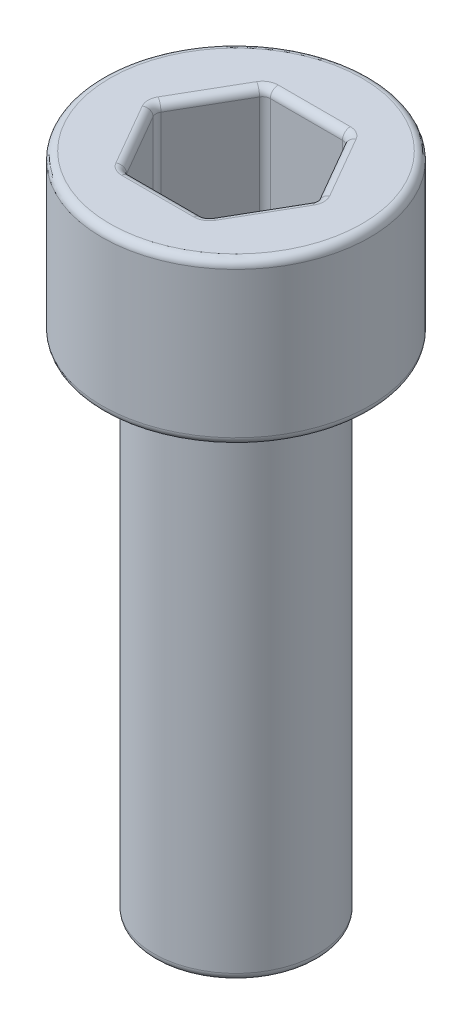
ISO-10303-21;
HEADER;
FILE_DESCRIPTION(('STEP AP214'),'2;1');
FILE_NAME('part.step','',(''),(''),'','','');
FILE_SCHEMA(('AUTOMOTIVE_DESIGN { 1 0 10303 214 1 1 1 1 }'));
ENDSEC;
DATA;
#1=APPLICATION_CONTEXT('core data for automotive mechanical design processes');
#2=APPLICATION_PROTOCOL_DEFINITION('international standard','automotive_design',2000,#1);
#3=PRODUCT_CONTEXT('',#1,'mechanical');
#4=PRODUCT('Part','Part','',(#3));
#5=PRODUCT_RELATED_PRODUCT_CATEGORY('part','',(#4));
#6=PRODUCT_DEFINITION_FORMATION('','',#4);
#7=PRODUCT_DEFINITION_CONTEXT('part definition',#1,'design');
#8=PRODUCT_DEFINITION('design','',#6,#7);
#9=PRODUCT_DEFINITION_SHAPE('','',#8);
#10=(LENGTH_UNIT() NAMED_UNIT(*) SI_UNIT(.MILLI.,.METRE.));
#11=(NAMED_UNIT(*) PLANE_ANGLE_UNIT() SI_UNIT($,.RADIAN.));
#12=(NAMED_UNIT(*) SI_UNIT($,.STERADIAN.) SOLID_ANGLE_UNIT());
#13=UNCERTAINTY_MEASURE_WITH_UNIT(LENGTH_MEASURE(1.E-05),#10,'distance_accuracy_value','');
#14=(GEOMETRIC_REPRESENTATION_CONTEXT(3) GLOBAL_UNCERTAINTY_ASSIGNED_CONTEXT((#13)) GLOBAL_UNIT_ASSIGNED_CONTEXT((#10,
#11,#12)) REPRESENTATION_CONTEXT('',''));
#15=CARTESIAN_POINT('',(0.,0.,0.));
#16=DIRECTION('',(0.,0.,1.));
#17=DIRECTION('',(1.,0.,0.));
#18=AXIS2_PLACEMENT_3D('',#15,#16,#17);
#19=CARTESIAN_POINT('',(0.,-12.7,0.));
#20=DIRECTION('',(0.,1.,0.));
#21=DIRECTION('',(0.,0.,1.));
#22=AXIS2_PLACEMENT_3D('',#19,#20,#21);
#23=CYLINDRICAL_SURFACE('',#22,2.085);
#24=CARTESIAN_POINT('',(0.,-12.5,0.));
#25=DIRECTION('',(0.,1.,0.));
#26=DIRECTION('',(0.,0.,1.));
#27=AXIS2_PLACEMENT_3D('',#24,#25,#26);
#28=CIRCLE('',#27,2.085);
#29=CARTESIAN_POINT('',(0.,-12.5,2.085));
#30=VERTEX_POINT('',#29);
#31=EDGE_CURVE('E351',#30,#30,#28,.T.);
#32=ORIENTED_EDGE('',*,*,#31,.T.);
#33=EDGE_LOOP('',(#32));
#34=FACE_BOUND('',#33,.T.);
#35=CARTESIAN_POINT('',(0.,0.,0.));
#36=DIRECTION('',(0.,1.,0.));
#37=DIRECTION('',(0.,0.,1.));
#38=AXIS2_PLACEMENT_3D('',#35,#36,#37);
#39=CIRCLE('',#38,2.085);
#40=CARTESIAN_POINT('',(0.,0.,2.085));
#41=VERTEX_POINT('',#40);
#42=EDGE_CURVE('E201',#41,#41,#39,.T.);
#43=ORIENTED_EDGE('',*,*,#42,.F.);
#44=EDGE_LOOP('',(#43));
#45=FACE_BOUND('',#44,.T.);
#46=ADVANCED_FACE('F34',(#34,#45),#23,.T.);
#47=CARTESIAN_POINT('',(0.,-12.7,0.));
#48=DIRECTION('',(0.,1.,0.));
#49=DIRECTION('',(0.,0.,1.));
#50=AXIS2_PLACEMENT_3D('',#47,#48,#49);
#51=PLANE('',#50);
#52=CARTESIAN_POINT('',(0.,-12.7,0.));
#53=DIRECTION('',(0.,1.,0.));
#54=DIRECTION('',(0.,0.,1.));
#55=AXIS2_PLACEMENT_3D('',#52,#53,#54);
#56=CIRCLE('',#55,1.885);
#57=CARTESIAN_POINT('',(0.,-12.7,1.885));
#58=VERTEX_POINT('',#57);
#59=EDGE_CURVE('E354',#58,#58,#56,.F.);
#60=ORIENTED_EDGE('',*,*,#59,.T.);
#61=EDGE_LOOP('',(#60));
#62=FACE_BOUND('',#61,.T.);
#63=ADVANCED_FACE('F483',(#62),#51,.F.);
#64=CARTESIAN_POINT('',(0.,4.1,0.));
#65=DIRECTION('',(0.,-1.,0.));
#66=DIRECTION('',(0.,0.,-1.));
#67=AXIS2_PLACEMENT_3D('',#64,#65,#66);
#68=CYLINDRICAL_SURFACE('',#67,3.4);
#69=CARTESIAN_POINT('',(0.,0.2,0.));
#70=DIRECTION('',(0.,1.,0.));
#71=DIRECTION('',(0.,0.,1.));
#72=AXIS2_PLACEMENT_3D('',#69,#70,#71);
#73=CIRCLE('',#72,3.4);
#74=CARTESIAN_POINT('',(0.,0.2,3.4));
#75=VERTEX_POINT('',#74);
#76=EDGE_CURVE('E43',#75,#75,#73,.T.);
#77=ORIENTED_EDGE('',*,*,#76,.T.);
#78=EDGE_LOOP('',(#77));
#79=FACE_BOUND('',#78,.T.);
#80=CARTESIAN_POINT('',(0.,3.9,0.));
#81=DIRECTION('',(0.,1.,0.));
#82=DIRECTION('',(0.,0.,1.));
#83=AXIS2_PLACEMENT_3D('',#80,#81,#82);
#84=CIRCLE('',#83,3.4);
#85=CARTESIAN_POINT('',(0.,3.9,3.4));
#86=VERTEX_POINT('',#85);
#87=EDGE_CURVE('E357',#86,#86,#84,.F.);
#88=ORIENTED_EDGE('',*,*,#87,.T.);
#89=EDGE_LOOP('',(#88));
#90=FACE_BOUND('',#89,.T.);
#91=ADVANCED_FACE('F489',(#79,#90),#68,.T.);
#92=CARTESIAN_POINT('',(0.,4.1,0.));
#93=DIRECTION('',(0.,1.,0.));
#94=DIRECTION('',(0.,0.,1.));
#95=AXIS2_PLACEMENT_3D('',#92,#93,#94);
#96=PLANE('',#95);
#97=CARTESIAN_POINT('',(1.83128288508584,4.1,0.));
#98=DIRECTION('',(0.,1.,0.));
#99=DIRECTION('',(0.,0.,1.));
#100=AXIS2_PLACEMENT_3D('',#97,#98,#99);
#101=CIRCLE('',#100,0.4);
#102=CARTESIAN_POINT('',(2.17769304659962,4.1,0.2));
#103=VERTEX_POINT('',#102);
#104=CARTESIAN_POINT('',(2.17769304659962,4.1,-0.2));
#105=VERTEX_POINT('',#104);
#106=EDGE_CURVE('E302',#103,#105,#101,.T.);
#107=ORIENTED_EDGE('',*,*,#106,.F.);
#108=DIRECTION('',(0.5,0.,-0.866025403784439));
#109=VECTOR('',#108,1.);
#110=CARTESIAN_POINT('',(1.20431657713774,4.1,1.8859375));
#111=LINE('',#110,#109);
#112=CARTESIAN_POINT('',(1.2620516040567,4.1,1.7859375));
#113=VERTEX_POINT('',#112);
#114=EDGE_CURVE('E308',#103,#113,#111,.F.);
#115=ORIENTED_EDGE('',*,*,#114,.T.);
#116=CARTESIAN_POINT('',(0.915641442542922,4.1,1.5859375));
#117=DIRECTION('',(0.,1.,0.));
#118=DIRECTION('',(0.,0.,1.));
#119=AXIS2_PLACEMENT_3D('',#116,#117,#118);
#120=CIRCLE('',#119,0.4);
#121=CARTESIAN_POINT('',(0.915641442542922,4.1,1.9859375));
#122=VERTEX_POINT('',#121);
#123=EDGE_CURVE('E305',#122,#113,#120,.T.);
#124=ORIENTED_EDGE('',*,*,#123,.F.);
#125=DIRECTION('',(1.,0.,0.));
#126=VECTOR('',#125,1.);
#127=CARTESIAN_POINT('',(-1.03111149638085,4.1,1.9859375));
#128=LINE('',#127,#126);
#129=CARTESIAN_POINT('',(-0.915641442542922,4.1,1.9859375));
#130=VERTEX_POINT('',#129);
#131=EDGE_CURVE('E299',#122,#130,#128,.F.);
#132=ORIENTED_EDGE('',*,*,#131,.T.);
#133=CARTESIAN_POINT('',(-0.915641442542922,4.1,1.5859375));
#134=DIRECTION('',(0.,1.,0.));
#135=DIRECTION('',(0.,0.,1.));
#136=AXIS2_PLACEMENT_3D('',#133,#134,#135);
#137=CIRCLE('',#136,0.4);
#138=CARTESIAN_POINT('',(-1.2620516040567,4.1,1.7859375));
#139=VERTEX_POINT('',#138);
#140=EDGE_CURVE('E297',#139,#130,#137,.T.);
#141=ORIENTED_EDGE('',*,*,#140,.F.);
#142=DIRECTION('',(0.5,0.,0.866025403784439));
#143=VECTOR('',#142,1.);
#144=CARTESIAN_POINT('',(-2.23542807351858,4.1,0.1));
#145=LINE('',#144,#143);
#146=CARTESIAN_POINT('',(-2.17769304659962,4.1,0.2));
#147=VERTEX_POINT('',#146);
#148=EDGE_CURVE('E293',#139,#147,#145,.F.);
#149=ORIENTED_EDGE('',*,*,#148,.T.);
#150=CARTESIAN_POINT('',(-1.83128288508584,4.1,0.));
#151=DIRECTION('',(0.,1.,0.));
#152=DIRECTION('',(0.,0.,1.));
#153=AXIS2_PLACEMENT_3D('',#150,#151,#152);
#154=CIRCLE('',#153,0.4);
#155=CARTESIAN_POINT('',(-2.17769304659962,4.1,-0.199999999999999));
#156=VERTEX_POINT('',#155);
#157=EDGE_CURVE('E290',#156,#147,#154,.T.);
#158=ORIENTED_EDGE('',*,*,#157,.F.);
#159=DIRECTION('',(-0.5,0.,0.866025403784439));
#160=VECTOR('',#159,1.);
#161=CARTESIAN_POINT('',(-1.20431657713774,4.1,-1.8859375));
#162=LINE('',#161,#160);
#163=CARTESIAN_POINT('',(-1.2620516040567,4.1,-1.7859375));
#164=VERTEX_POINT('',#163);
#165=EDGE_CURVE('E288',#156,#164,#162,.F.);
#166=ORIENTED_EDGE('',*,*,#165,.T.);
#167=CARTESIAN_POINT('',(-0.915641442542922,4.1,-1.5859375));
#168=DIRECTION('',(0.,1.,0.));
#169=DIRECTION('',(0.,0.,1.));
#170=AXIS2_PLACEMENT_3D('',#167,#168,#169);
#171=CIRCLE('',#170,0.4);
#172=CARTESIAN_POINT('',(-0.915641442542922,4.1,-1.9859375));
#173=VERTEX_POINT('',#172);
#174=EDGE_CURVE('E286',#173,#164,#171,.T.);
#175=ORIENTED_EDGE('',*,*,#174,.F.);
#176=DIRECTION('',(-1.,0.,0.));
#177=VECTOR('',#176,1.);
#178=CARTESIAN_POINT('',(1.03111149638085,4.1,-1.9859375));
#179=LINE('',#178,#177);
#180=CARTESIAN_POINT('',(0.915641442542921,4.1,-1.9859375));
#181=VERTEX_POINT('',#180);
#182=EDGE_CURVE('E284',#173,#181,#179,.F.);
#183=ORIENTED_EDGE('',*,*,#182,.T.);
#184=CARTESIAN_POINT('',(0.915641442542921,4.1,-1.5859375));
#185=DIRECTION('',(0.,1.,0.));
#186=DIRECTION('',(0.,0.,1.));
#187=AXIS2_PLACEMENT_3D('',#184,#185,#186);
#188=CIRCLE('',#187,0.4);
#189=CARTESIAN_POINT('',(1.2620516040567,4.1,-1.7859375));
#190=VERTEX_POINT('',#189);
#191=EDGE_CURVE('E282',#190,#181,#188,.T.);
#192=ORIENTED_EDGE('',*,*,#191,.F.);
#193=DIRECTION('',(-0.5,0.,-0.866025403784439));
#194=VECTOR('',#193,1.);
#195=CARTESIAN_POINT('',(2.23542807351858,4.1,-0.100000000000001));
#196=LINE('',#195,#194);
#197=EDGE_CURVE('E295',#190,#105,#196,.F.);
#198=ORIENTED_EDGE('',*,*,#197,.T.);
#199=EDGE_LOOP('',(#107,#115,#124,#132,#141,#149,#158,#166,#175,#183,#192,#198));
#200=FACE_BOUND('',#199,.T.);
#201=CARTESIAN_POINT('',(0.,4.1,0.));
#202=DIRECTION('',(0.,1.,0.));
#203=DIRECTION('',(0.,0.,1.));
#204=AXIS2_PLACEMENT_3D('',#201,#202,#203);
#205=CIRCLE('',#204,3.2);
#206=CARTESIAN_POINT('',(0.,4.1,3.2));
#207=VERTEX_POINT('',#206);
#208=EDGE_CURVE('E279',#207,#207,#205,.T.);
#209=ORIENTED_EDGE('',*,*,#208,.T.);
#210=EDGE_LOOP('',(#209));
#211=FACE_BOUND('',#210,.T.);
#212=ADVANCED_FACE('F460',(#200,#211),#96,.T.);
#213=CARTESIAN_POINT('',(0.,0.,0.));
#214=DIRECTION('',(0.,1.,0.));
#215=DIRECTION('',(0.,0.,1.));
#216=AXIS2_PLACEMENT_3D('',#213,#214,#215);
#217=PLANE('',#216);
#218=CARTESIAN_POINT('',(0.,0.,0.));
#219=DIRECTION('',(0.,1.,0.));
#220=DIRECTION('',(0.,0.,1.));
#221=AXIS2_PLACEMENT_3D('',#218,#219,#220);
#222=CIRCLE('',#221,3.2);
#223=CARTESIAN_POINT('',(0.,0.,3.2));
#224=VERTEX_POINT('',#223);
#225=EDGE_CURVE('E11',#224,#224,#222,.F.);
#226=ORIENTED_EDGE('',*,*,#225,.T.);
#227=EDGE_LOOP('',(#226));
#228=FACE_BOUND('',#227,.T.);
#229=ORIENTED_EDGE('',*,*,#42,.T.);
#230=EDGE_LOOP('',(#229));
#231=FACE_BOUND('',#230,.T.);
#232=ADVANCED_FACE('F560',(#228,#231),#217,.F.);
#233=CARTESIAN_POINT('',(1.03111149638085,1.1,1.7859375));
#234=DIRECTION('',(0.866025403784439,0.,0.5));
#235=DIRECTION('',(0.5,0.,-0.866025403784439));
#236=AXIS2_PLACEMENT_3D('',#233,#234,#235);
#237=PLANE('',#236);
#238=DIRECTION('',(0.5,0.,-0.866025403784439));
#239=VECTOR('',#238,1.);
#240=CARTESIAN_POINT('',(1.03111149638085,1.3,1.7859375));
#241=LINE('',#240,#239);
#242=CARTESIAN_POINT('',(2.00448796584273,1.3,0.0999999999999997));
#243=VERTEX_POINT('',#242);
#244=CARTESIAN_POINT('',(1.08884652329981,1.3,1.6859375));
#245=VERTEX_POINT('',#244);
#246=EDGE_CURVE('E314',#243,#245,#241,.F.);
#247=ORIENTED_EDGE('',*,*,#246,.T.);
#248=DIRECTION('',(0.,1.,0.));
#249=VECTOR('',#248,1.);
#250=CARTESIAN_POINT('',(1.08884652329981,4.1,1.6859375));
#251=LINE('',#250,#249);
#252=CARTESIAN_POINT('',(1.08884652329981,3.9,1.6859375));
#253=VERTEX_POINT('',#252);
#254=EDGE_CURVE('E316',#245,#253,#251,.T.);
#255=ORIENTED_EDGE('',*,*,#254,.T.);
#256=DIRECTION('',(0.5,0.,-0.866025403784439));
#257=VECTOR('',#256,1.);
#258=CARTESIAN_POINT('',(2.06222299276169,3.9,0.));
#259=LINE('',#258,#257);
#260=CARTESIAN_POINT('',(2.00448796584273,3.9,0.0999999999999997));
#261=VERTEX_POINT('',#260);
#262=EDGE_CURVE('E312',#253,#261,#259,.T.);
#263=ORIENTED_EDGE('',*,*,#262,.T.);
#264=DIRECTION('',(0.,1.,0.));
#265=VECTOR('',#264,1.);
#266=CARTESIAN_POINT('',(2.00448796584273,1.1,0.0999999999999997));
#267=LINE('',#266,#265);
#268=EDGE_CURVE('E310',#261,#243,#267,.F.);
#269=ORIENTED_EDGE('',*,*,#268,.T.);
#270=EDGE_LOOP('',(#247,#255,#263,#269));
#271=FACE_BOUND('',#270,.T.);
#272=ADVANCED_FACE('F429',(#271),#237,.F.);
#273=CARTESIAN_POINT('',(-1.03111149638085,1.1,1.7859375));
#274=DIRECTION('',(0.,0.,1.));
#275=DIRECTION('',(1.,0.,0.));
#276=AXIS2_PLACEMENT_3D('',#273,#274,#275);
#277=PLANE('',#276);
#278=DIRECTION('',(1.,0.,0.));
#279=VECTOR('',#278,1.);
#280=CARTESIAN_POINT('',(1.03111149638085,3.9,1.7859375));
#281=LINE('',#280,#279);
#282=CARTESIAN_POINT('',(-0.915641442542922,3.9,1.7859375));
#283=VERTEX_POINT('',#282);
#284=CARTESIAN_POINT('',(0.915641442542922,3.9,1.7859375));
#285=VERTEX_POINT('',#284);
#286=EDGE_CURVE('E272',#283,#285,#281,.T.);
#287=ORIENTED_EDGE('',*,*,#286,.T.);
#288=DIRECTION('',(0.,1.,0.));
#289=VECTOR('',#288,1.);
#290=CARTESIAN_POINT('',(0.915641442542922,1.1,1.7859375));
#291=LINE('',#290,#289);
#292=CARTESIAN_POINT('',(0.915641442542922,1.3,1.7859375));
#293=VERTEX_POINT('',#292);
#294=EDGE_CURVE('E277',#285,#293,#291,.F.);
#295=ORIENTED_EDGE('',*,*,#294,.T.);
#296=DIRECTION('',(1.,0.,0.));
#297=VECTOR('',#296,1.);
#298=CARTESIAN_POINT('',(-1.03111149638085,1.3,1.7859375));
#299=LINE('',#298,#297);
#300=CARTESIAN_POINT('',(-0.915641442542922,1.3,1.7859375));
#301=VERTEX_POINT('',#300);
#302=EDGE_CURVE('E274',#293,#301,#299,.F.);
#303=ORIENTED_EDGE('',*,*,#302,.T.);
#304=DIRECTION('',(0.,1.,0.));
#305=VECTOR('',#304,1.);
#306=CARTESIAN_POINT('',(-0.915641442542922,4.1,1.7859375));
#307=LINE('',#306,#305);
#308=EDGE_CURVE('E270',#301,#283,#307,.T.);
#309=ORIENTED_EDGE('',*,*,#308,.T.);
#310=EDGE_LOOP('',(#287,#295,#303,#309));
#311=FACE_BOUND('',#310,.T.);
#312=ADVANCED_FACE('F449',(#311),#277,.F.);
#313=CARTESIAN_POINT('',(-2.06222299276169,1.1,0.));
#314=DIRECTION('',(-0.866025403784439,0.,0.5));
#315=DIRECTION('',(0.5,0.,0.866025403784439));
#316=AXIS2_PLACEMENT_3D('',#313,#314,#315);
#317=PLANE('',#316);
#318=DIRECTION('',(0.,1.,0.));
#319=VECTOR('',#318,1.);
#320=CARTESIAN_POINT('',(-1.08884652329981,1.1,1.6859375));
#321=LINE('',#320,#319);
#322=CARTESIAN_POINT('',(-1.08884652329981,3.9,1.6859375));
#323=VERTEX_POINT('',#322);
#324=CARTESIAN_POINT('',(-1.08884652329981,1.3,1.6859375));
#325=VERTEX_POINT('',#324);
#326=EDGE_CURVE('E331',#323,#325,#321,.F.);
#327=ORIENTED_EDGE('',*,*,#326,.T.);
#328=DIRECTION('',(0.5,0.,0.866025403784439));
#329=VECTOR('',#328,1.);
#330=CARTESIAN_POINT('',(-2.06222299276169,1.3,0.));
#331=LINE('',#330,#329);
#332=CARTESIAN_POINT('',(-2.00448796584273,1.3,0.1));
#333=VERTEX_POINT('',#332);
#334=EDGE_CURVE('E333',#325,#333,#331,.F.);
#335=ORIENTED_EDGE('',*,*,#334,.T.);
#336=DIRECTION('',(0.,1.,0.));
#337=VECTOR('',#336,1.);
#338=CARTESIAN_POINT('',(-2.00448796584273,4.1,0.1));
#339=LINE('',#338,#337);
#340=CARTESIAN_POINT('',(-2.00448796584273,3.9,0.1));
#341=VERTEX_POINT('',#340);
#342=EDGE_CURVE('E327',#333,#341,#339,.T.);
#343=ORIENTED_EDGE('',*,*,#342,.T.);
#344=DIRECTION('',(0.5,0.,0.866025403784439));
#345=VECTOR('',#344,1.);
#346=CARTESIAN_POINT('',(-1.03111149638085,3.9,1.7859375));
#347=LINE('',#346,#345);
#348=EDGE_CURVE('E329',#341,#323,#347,.T.);
#349=ORIENTED_EDGE('',*,*,#348,.T.);
#350=EDGE_LOOP('',(#327,#335,#343,#349));
#351=FACE_BOUND('',#350,.T.);
#352=ADVANCED_FACE('F553',(#351),#317,.F.);
#353=CARTESIAN_POINT('',(-1.03111149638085,1.1,-1.7859375));
#354=DIRECTION('',(-0.866025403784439,0.,-0.5));
#355=DIRECTION('',(-0.5,0.,0.866025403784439));
#356=AXIS2_PLACEMENT_3D('',#353,#354,#355);
#357=PLANE('',#356);
#358=DIRECTION('',(0.,1.,0.));
#359=VECTOR('',#358,1.);
#360=CARTESIAN_POINT('',(-2.00448796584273,1.1,-0.0999999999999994));
#361=LINE('',#360,#359);
#362=CARTESIAN_POINT('',(-2.00448796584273,3.9,-0.0999999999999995));
#363=VERTEX_POINT('',#362);
#364=CARTESIAN_POINT('',(-2.00448796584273,1.3,-0.0999999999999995));
#365=VERTEX_POINT('',#364);
#366=EDGE_CURVE('E340',#363,#365,#361,.F.);
#367=ORIENTED_EDGE('',*,*,#366,.T.);
#368=DIRECTION('',(-0.5,0.,0.866025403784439));
#369=VECTOR('',#368,1.);
#370=CARTESIAN_POINT('',(-1.03111149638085,1.3,-1.7859375));
#371=LINE('',#370,#369);
#372=CARTESIAN_POINT('',(-1.08884652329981,1.3,-1.6859375));
#373=VERTEX_POINT('',#372);
#374=EDGE_CURVE('E342',#365,#373,#371,.F.);
#375=ORIENTED_EDGE('',*,*,#374,.T.);
#376=DIRECTION('',(0.,1.,0.));
#377=VECTOR('',#376,1.);
#378=CARTESIAN_POINT('',(-1.08884652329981,4.1,-1.6859375));
#379=LINE('',#378,#377);
#380=CARTESIAN_POINT('',(-1.08884652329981,3.9,-1.6859375));
#381=VERTEX_POINT('',#380);
#382=EDGE_CURVE('E336',#373,#381,#379,.T.);
#383=ORIENTED_EDGE('',*,*,#382,.T.);
#384=DIRECTION('',(-0.5,0.,0.866025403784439));
#385=VECTOR('',#384,1.);
#386=CARTESIAN_POINT('',(-2.06222299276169,3.9,0.));
#387=LINE('',#386,#385);
#388=EDGE_CURVE('E338',#381,#363,#387,.T.);
#389=ORIENTED_EDGE('',*,*,#388,.T.);
#390=EDGE_LOOP('',(#367,#375,#383,#389));
#391=FACE_BOUND('',#390,.T.);
#392=ADVANCED_FACE('F546',(#391),#357,.F.);
#393=CARTESIAN_POINT('',(1.03111149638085,1.1,-1.7859375));
#394=DIRECTION('',(0.,0.,-1.));
#395=DIRECTION('',(-1.,0.,0.));
#396=AXIS2_PLACEMENT_3D('',#393,#394,#395);
#397=PLANE('',#396);
#398=DIRECTION('',(-1.,0.,0.));
#399=VECTOR('',#398,1.);
#400=CARTESIAN_POINT('',(1.03111149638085,1.3,-1.7859375));
#401=LINE('',#400,#399);
#402=CARTESIAN_POINT('',(-0.915641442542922,1.3,-1.7859375));
#403=VERTEX_POINT('',#402);
#404=CARTESIAN_POINT('',(0.915641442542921,1.3,-1.7859375));
#405=VERTEX_POINT('',#404);
#406=EDGE_CURVE('E51',#403,#405,#401,.F.);
#407=ORIENTED_EDGE('',*,*,#406,.T.);
#408=DIRECTION('',(0.,1.,0.));
#409=VECTOR('',#408,1.);
#410=CARTESIAN_POINT('',(0.915641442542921,4.1,-1.7859375));
#411=LINE('',#410,#409);
#412=CARTESIAN_POINT('',(0.915641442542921,3.9,-1.7859375));
#413=VERTEX_POINT('',#412);
#414=EDGE_CURVE('E349',#405,#413,#411,.T.);
#415=ORIENTED_EDGE('',*,*,#414,.T.);
#416=DIRECTION('',(-1.,0.,0.));
#417=VECTOR('',#416,1.);
#418=CARTESIAN_POINT('',(-1.03111149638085,3.9,-1.7859375));
#419=LINE('',#418,#417);
#420=CARTESIAN_POINT('',(-0.915641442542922,3.9,-1.7859375));
#421=VERTEX_POINT('',#420);
#422=EDGE_CURVE('E345',#413,#421,#419,.T.);
#423=ORIENTED_EDGE('',*,*,#422,.T.);
#424=DIRECTION('',(0.,1.,0.));
#425=VECTOR('',#424,1.);
#426=CARTESIAN_POINT('',(-0.915641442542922,1.1,-1.7859375));
#427=LINE('',#426,#425);
#428=EDGE_CURVE('E56',#421,#403,#427,.F.);
#429=ORIENTED_EDGE('',*,*,#428,.T.);
#430=EDGE_LOOP('',(#407,#415,#423,#429));
#431=FACE_BOUND('',#430,.T.);
#432=ADVANCED_FACE('F544',(#431),#397,.F.);
#433=CARTESIAN_POINT('',(2.06222299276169,1.1,0.));
#434=DIRECTION('',(0.866025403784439,0.,-0.5));
#435=DIRECTION('',(-0.5,0.,-0.866025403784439));
#436=AXIS2_PLACEMENT_3D('',#433,#434,#435);
#437=PLANE('',#436);
#438=DIRECTION('',(-0.5,0.,-0.866025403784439));
#439=VECTOR('',#438,1.);
#440=CARTESIAN_POINT('',(2.06222299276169,1.3,0.));
#441=LINE('',#440,#439);
#442=CARTESIAN_POINT('',(1.08884652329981,1.3,-1.6859375));
#443=VERTEX_POINT('',#442);
#444=CARTESIAN_POINT('',(2.00448796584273,1.3,-0.1));
#445=VERTEX_POINT('',#444);
#446=EDGE_CURVE('E212',#443,#445,#441,.F.);
#447=ORIENTED_EDGE('',*,*,#446,.T.);
#448=DIRECTION('',(0.,1.,0.));
#449=VECTOR('',#448,1.);
#450=CARTESIAN_POINT('',(2.00448796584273,4.1,-0.1));
#451=LINE('',#450,#449);
#452=CARTESIAN_POINT('',(2.00448796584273,3.9,-0.1));
#453=VERTEX_POINT('',#452);
#454=EDGE_CURVE('E324',#445,#453,#451,.T.);
#455=ORIENTED_EDGE('',*,*,#454,.T.);
#456=DIRECTION('',(-0.5,0.,-0.866025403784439));
#457=VECTOR('',#456,1.);
#458=CARTESIAN_POINT('',(1.03111149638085,3.9,-1.7859375));
#459=LINE('',#458,#457);
#460=CARTESIAN_POINT('',(1.08884652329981,3.9,-1.6859375));
#461=VERTEX_POINT('',#460);
#462=EDGE_CURVE('E321',#453,#461,#459,.T.);
#463=ORIENTED_EDGE('',*,*,#462,.T.);
#464=DIRECTION('',(0.,1.,0.));
#465=VECTOR('',#464,1.);
#466=CARTESIAN_POINT('',(1.08884652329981,1.1,-1.6859375));
#467=LINE('',#466,#465);
#468=EDGE_CURVE('E319',#461,#443,#467,.F.);
#469=ORIENTED_EDGE('',*,*,#468,.T.);
#470=EDGE_LOOP('',(#447,#455,#463,#469));
#471=FACE_BOUND('',#470,.T.);
#472=ADVANCED_FACE('F467',(#471),#437,.F.);
#473=CARTESIAN_POINT('',(0.,1.1,0.));
#474=DIRECTION('',(0.,1.,0.));
#475=DIRECTION('',(0.,0.,1.));
#476=AXIS2_PLACEMENT_3D('',#473,#474,#475);
#477=PLANE('',#476);
#478=DIRECTION('',(0.5,0.,0.866025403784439));
#479=VECTOR('',#478,1.);
#480=CARTESIAN_POINT('',(-1.37346216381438,1.1,0.79296875));
#481=LINE('',#480,#479);
#482=CARTESIAN_POINT('',(-1.83128288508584,1.1,0.));
#483=VERTEX_POINT('',#482);
#484=CARTESIAN_POINT('',(-0.915641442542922,1.1,1.5859375));
#485=VERTEX_POINT('',#484);
#486=EDGE_CURVE('E189',#483,#485,#481,.T.);
#487=ORIENTED_EDGE('',*,*,#486,.T.);
#488=DIRECTION('',(1.,0.,0.));
#489=VECTOR('',#488,1.);
#490=CARTESIAN_POINT('',(0.,1.1,1.5859375));
#491=LINE('',#490,#489);
#492=CARTESIAN_POINT('',(0.915641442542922,1.1,1.5859375));
#493=VERTEX_POINT('',#492);
#494=EDGE_CURVE('E268',#485,#493,#491,.T.);
#495=ORIENTED_EDGE('',*,*,#494,.T.);
#496=DIRECTION('',(0.5,0.,-0.866025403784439));
#497=VECTOR('',#496,1.);
#498=CARTESIAN_POINT('',(1.37346216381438,1.1,0.792968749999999));
#499=LINE('',#498,#497);
#500=CARTESIAN_POINT('',(1.83128288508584,1.1,0.));
#501=VERTEX_POINT('',#500);
#502=EDGE_CURVE('E184',#493,#501,#499,.T.);
#503=ORIENTED_EDGE('',*,*,#502,.T.);
#504=DIRECTION('',(-0.5,0.,-0.866025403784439));
#505=VECTOR('',#504,1.);
#506=CARTESIAN_POINT('',(1.37346216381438,1.1,-0.79296875));
#507=LINE('',#506,#505);
#508=CARTESIAN_POINT('',(0.915641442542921,1.1,-1.5859375));
#509=VERTEX_POINT('',#508);
#510=EDGE_CURVE('E177',#501,#509,#507,.T.);
#511=ORIENTED_EDGE('',*,*,#510,.T.);
#512=DIRECTION('',(-1.,0.,0.));
#513=VECTOR('',#512,1.);
#514=CARTESIAN_POINT('',(0.,1.1,-1.5859375));
#515=LINE('',#514,#513);
#516=CARTESIAN_POINT('',(-0.915641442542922,1.1,-1.5859375));
#517=VERTEX_POINT('',#516);
#518=EDGE_CURVE('E180',#509,#517,#515,.T.);
#519=ORIENTED_EDGE('',*,*,#518,.T.);
#520=DIRECTION('',(-0.5,0.,0.866025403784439));
#521=VECTOR('',#520,1.);
#522=CARTESIAN_POINT('',(-1.37346216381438,1.1,-0.79296875));
#523=LINE('',#522,#521);
#524=EDGE_CURVE('E200',#517,#483,#523,.T.);
#525=ORIENTED_EDGE('',*,*,#524,.T.);
#526=EDGE_LOOP('',(#487,#495,#503,#511,#519,#525));
#527=FACE_BOUND('',#526,.T.);
#528=ADVANCED_FACE('F179',(#527),#477,.T.);
#529=CARTESIAN_POINT('',(1.03111149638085,3.9,-1.9859375));
#530=DIRECTION('',(1.,0.,0.));
#531=DIRECTION('',(0.,0.,-1.));
#532=AXIS2_PLACEMENT_3D('',#529,#530,#531);
#533=CYLINDRICAL_SURFACE('',#532,0.2);
#534=CARTESIAN_POINT('',(0.915641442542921,3.9,-1.9859375));
#535=DIRECTION('',(1.,0.,0.));
#536=DIRECTION('',(0.,0.,-1.));
#537=AXIS2_PLACEMENT_3D('',#534,#535,#536);
#538=CIRCLE('',#537,0.2);
#539=EDGE_CURVE('E248',#181,#413,#538,.T.);
#540=ORIENTED_EDGE('',*,*,#539,.F.);
#541=ORIENTED_EDGE('',*,*,#182,.F.);
#542=CARTESIAN_POINT('',(-0.915641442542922,3.9,-1.9859375));
#543=DIRECTION('',(-1.,0.,0.));
#544=DIRECTION('',(0.,0.,1.));
#545=AXIS2_PLACEMENT_3D('',#542,#543,#544);
#546=CIRCLE('',#545,0.2);
#547=EDGE_CURVE('E38',#421,#173,#546,.T.);
#548=ORIENTED_EDGE('',*,*,#547,.F.);
#549=ORIENTED_EDGE('',*,*,#422,.F.);
#550=EDGE_LOOP('',(#540,#541,#548,#549));
#551=FACE_BOUND('',#550,.T.);
#552=ADVANCED_FACE('F539',(#551),#533,.T.);
#553=CARTESIAN_POINT('',(-0.915641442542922,3.9,-1.5859375));
#554=DIRECTION('',(0.,1.,0.));
#555=DIRECTION('',(0.,0.,1.));
#556=AXIS2_PLACEMENT_3D('',#553,#554,#555);
#557=TOROIDAL_SURFACE('',#556,0.4,0.2);
#558=ORIENTED_EDGE('',*,*,#547,.T.);
#559=ORIENTED_EDGE('',*,*,#174,.T.);
#560=CARTESIAN_POINT('',(-1.2620516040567,3.9,-1.7859375));
#561=DIRECTION('',(0.5,0.,-0.866025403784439));
#562=DIRECTION('',(-0.866025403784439,0.,-0.5));
#563=AXIS2_PLACEMENT_3D('',#560,#561,#562);
#564=CIRCLE('',#563,0.2);
#565=EDGE_CURVE('E246',#381,#164,#564,.F.);
#566=ORIENTED_EDGE('',*,*,#565,.F.);
#567=CARTESIAN_POINT('',(-0.915641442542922,3.9,-1.5859375));
#568=DIRECTION('',(0.,1.,0.));
#569=DIRECTION('',(0.,0.,1.));
#570=AXIS2_PLACEMENT_3D('',#567,#568,#569);
#571=CIRCLE('',#570,0.2);
#572=EDGE_CURVE('E243',#421,#381,#571,.T.);
#573=ORIENTED_EDGE('',*,*,#572,.F.);
#574=EDGE_LOOP('',(#558,#559,#566,#573));
#575=FACE_BOUND('',#574,.T.);
#576=ADVANCED_FACE('F536',(#575),#557,.T.);
#577=CARTESIAN_POINT('',(0.915641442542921,3.9,-1.5859375));
#578=DIRECTION('',(0.,1.,0.));
#579=DIRECTION('',(0.,0.,1.));
#580=AXIS2_PLACEMENT_3D('',#577,#578,#579);
#581=TOROIDAL_SURFACE('',#580,0.4,0.2);
#582=ORIENTED_EDGE('',*,*,#191,.T.);
#583=ORIENTED_EDGE('',*,*,#539,.T.);
#584=CARTESIAN_POINT('',(0.915641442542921,3.9,-1.5859375));
#585=DIRECTION('',(0.,1.,0.));
#586=DIRECTION('',(0.,0.,1.));
#587=AXIS2_PLACEMENT_3D('',#584,#585,#586);
#588=CIRCLE('',#587,0.2);
#589=EDGE_CURVE('E241',#461,#413,#588,.T.);
#590=ORIENTED_EDGE('',*,*,#589,.F.);
#591=CARTESIAN_POINT('',(1.2620516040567,3.9,-1.7859375));
#592=DIRECTION('',(-0.5,0.,-0.866025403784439));
#593=DIRECTION('',(-0.866025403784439,0.,0.5));
#594=AXIS2_PLACEMENT_3D('',#591,#592,#593);
#595=CIRCLE('',#594,0.2);
#596=EDGE_CURVE('E238',#190,#461,#595,.F.);
#597=ORIENTED_EDGE('',*,*,#596,.F.);
#598=EDGE_LOOP('',(#582,#583,#590,#597));
#599=FACE_BOUND('',#598,.T.);
#600=ADVANCED_FACE('F540',(#599),#581,.T.);
#601=CARTESIAN_POINT('',(-1.20431657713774,3.9,-1.8859375));
#602=DIRECTION('',(0.5,0.,-0.866025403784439));
#603=DIRECTION('',(-0.866025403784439,0.,-0.5));
#604=AXIS2_PLACEMENT_3D('',#601,#602,#603);
#605=CYLINDRICAL_SURFACE('',#604,0.2);
#606=ORIENTED_EDGE('',*,*,#565,.T.);
#607=ORIENTED_EDGE('',*,*,#165,.F.);
#608=CARTESIAN_POINT('',(-2.17769304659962,3.9,-0.199999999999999));
#609=DIRECTION('',(-0.5,0.,0.866025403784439));
#610=DIRECTION('',(0.866025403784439,0.,0.5));
#611=AXIS2_PLACEMENT_3D('',#608,#609,#610);
#612=CIRCLE('',#611,0.2);
#613=EDGE_CURVE('E235',#363,#156,#612,.T.);
#614=ORIENTED_EDGE('',*,*,#613,.F.);
#615=ORIENTED_EDGE('',*,*,#388,.F.);
#616=EDGE_LOOP('',(#606,#607,#614,#615));
#617=FACE_BOUND('',#616,.T.);
#618=ADVANCED_FACE('F533',(#617),#605,.T.);
#619=CARTESIAN_POINT('',(-0.915641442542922,1.1,-1.5859375));
#620=DIRECTION('',(0.,-1.,0.));
#621=DIRECTION('',(0.,0.,-1.));
#622=AXIS2_PLACEMENT_3D('',#619,#620,#621);
#623=CYLINDRICAL_SURFACE('',#622,0.2);
#624=ORIENTED_EDGE('',*,*,#572,.T.);
#625=ORIENTED_EDGE('',*,*,#382,.F.);
#626=CARTESIAN_POINT('',(-0.915641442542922,1.3,-1.5859375));
#627=DIRECTION('',(0.,1.,0.));
#628=DIRECTION('',(0.,0.,1.));
#629=AXIS2_PLACEMENT_3D('',#626,#627,#628);
#630=CIRCLE('',#629,0.2);
#631=EDGE_CURVE('E232',#403,#373,#630,.T.);
#632=ORIENTED_EDGE('',*,*,#631,.F.);
#633=ORIENTED_EDGE('',*,*,#428,.F.);
#634=EDGE_LOOP('',(#624,#625,#632,#633));
#635=FACE_BOUND('',#634,.T.);
#636=ADVANCED_FACE('F597',(#635),#623,.F.);
#637=CARTESIAN_POINT('',(0.,1.3,-1.5859375));
#638=DIRECTION('',(-1.,0.,0.));
#639=DIRECTION('',(0.,0.,1.));
#640=AXIS2_PLACEMENT_3D('',#637,#638,#639);
#641=CYLINDRICAL_SURFACE('',#640,0.2);
#642=CARTESIAN_POINT('',(0.915641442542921,1.3,-1.5859375));
#643=DIRECTION('',(-1.,0.,0.));
#644=DIRECTION('',(0.,-1.,0.));
#645=AXIS2_PLACEMENT_3D('',#642,#643,#644);
#646=CIRCLE('',#645,0.2);
#647=EDGE_CURVE('E195',#405,#509,#646,.T.);
#648=ORIENTED_EDGE('',*,*,#647,.F.);
#649=ORIENTED_EDGE('',*,*,#406,.F.);
#650=CARTESIAN_POINT('',(-0.915641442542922,1.3,-1.5859375));
#651=DIRECTION('',(1.,0.,0.));
#652=DIRECTION('',(0.,0.,-1.));
#653=AXIS2_PLACEMENT_3D('',#650,#651,#652);
#654=CIRCLE('',#653,0.2);
#655=EDGE_CURVE('E198',#517,#403,#654,.T.);
#656=ORIENTED_EDGE('',*,*,#655,.F.);
#657=ORIENTED_EDGE('',*,*,#518,.F.);
#658=EDGE_LOOP('',(#648,#649,#656,#657));
#659=FACE_BOUND('',#658,.T.);
#660=ADVANCED_FACE('F194',(#659),#641,.F.);
#661=CARTESIAN_POINT('',(0.915641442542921,1.1,-1.5859375));
#662=DIRECTION('',(0.,-1.,0.));
#663=DIRECTION('',(0.,0.,-1.));
#664=AXIS2_PLACEMENT_3D('',#661,#662,#663);
#665=CYLINDRICAL_SURFACE('',#664,0.2);
#666=ORIENTED_EDGE('',*,*,#589,.T.);
#667=ORIENTED_EDGE('',*,*,#414,.F.);
#668=CARTESIAN_POINT('',(0.915641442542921,1.3,-1.5859375));
#669=DIRECTION('',(0.,1.,0.));
#670=DIRECTION('',(0.,0.,1.));
#671=AXIS2_PLACEMENT_3D('',#668,#669,#670);
#672=CIRCLE('',#671,0.2);
#673=EDGE_CURVE('E209',#443,#405,#672,.T.);
#674=ORIENTED_EDGE('',*,*,#673,.F.);
#675=ORIENTED_EDGE('',*,*,#468,.F.);
#676=EDGE_LOOP('',(#666,#667,#674,#675));
#677=FACE_BOUND('',#676,.T.);
#678=ADVANCED_FACE('F543',(#677),#665,.F.);
#679=CARTESIAN_POINT('',(2.23542807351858,3.9,-0.100000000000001));
#680=DIRECTION('',(0.5,0.,0.866025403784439));
#681=DIRECTION('',(0.866025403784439,0.,-0.5));
#682=AXIS2_PLACEMENT_3D('',#679,#680,#681);
#683=CYLINDRICAL_SURFACE('',#682,0.2);
#684=ORIENTED_EDGE('',*,*,#596,.T.);
#685=ORIENTED_EDGE('',*,*,#462,.F.);
#686=CARTESIAN_POINT('',(2.17769304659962,3.9,-0.2));
#687=DIRECTION('',(0.5,0.,0.866025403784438));
#688=DIRECTION('',(0.866025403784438,0.,-0.5));
#689=AXIS2_PLACEMENT_3D('',#686,#687,#688);
#690=CIRCLE('',#689,0.2);
#691=EDGE_CURVE('E227',#105,#453,#690,.T.);
#692=ORIENTED_EDGE('',*,*,#691,.F.);
#693=ORIENTED_EDGE('',*,*,#197,.F.);
#694=EDGE_LOOP('',(#684,#685,#692,#693));
#695=FACE_BOUND('',#694,.T.);
#696=ADVANCED_FACE('F465',(#695),#683,.T.);
#697=CARTESIAN_POINT('',(-1.83128288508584,3.9,0.));
#698=DIRECTION('',(0.,1.,0.));
#699=DIRECTION('',(0.,0.,1.));
#700=AXIS2_PLACEMENT_3D('',#697,#698,#699);
#701=TOROIDAL_SURFACE('',#700,0.4,0.2);
#702=ORIENTED_EDGE('',*,*,#613,.T.);
#703=ORIENTED_EDGE('',*,*,#157,.T.);
#704=CARTESIAN_POINT('',(-2.17769304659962,3.9,0.2));
#705=DIRECTION('',(-0.5,0.,-0.866025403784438));
#706=DIRECTION('',(-0.866025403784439,0.,0.5));
#707=AXIS2_PLACEMENT_3D('',#704,#705,#706);
#708=CIRCLE('',#707,0.2);
#709=EDGE_CURVE('E224',#341,#147,#708,.F.);
#710=ORIENTED_EDGE('',*,*,#709,.F.);
#711=CARTESIAN_POINT('',(-1.83128288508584,3.9,0.));
#712=DIRECTION('',(0.,1.,0.));
#713=DIRECTION('',(0.,0.,1.));
#714=AXIS2_PLACEMENT_3D('',#711,#712,#713);
#715=CIRCLE('',#714,0.2);
#716=EDGE_CURVE('E216',#363,#341,#715,.T.);
#717=ORIENTED_EDGE('',*,*,#716,.F.);
#718=EDGE_LOOP('',(#702,#703,#710,#717));
#719=FACE_BOUND('',#718,.T.);
#720=ADVANCED_FACE('F528',(#719),#701,.T.);
#721=CARTESIAN_POINT('',(-0.915641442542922,1.3,-1.5859375));
#722=DIRECTION('',(0.,0.,1.));
#723=DIRECTION('',(1.,0.,0.));
#724=AXIS2_PLACEMENT_3D('',#721,#722,#723);
#725=SPHERICAL_SURFACE('',#724,0.2);
#726=ORIENTED_EDGE('',*,*,#655,.T.);
#727=ORIENTED_EDGE('',*,*,#631,.T.);
#728=CARTESIAN_POINT('',(-0.915641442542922,1.3,-1.5859375));
#729=DIRECTION('',(-0.5,0.,0.866025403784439));
#730=DIRECTION('',(0.866025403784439,0.,0.5));
#731=AXIS2_PLACEMENT_3D('',#728,#729,#730);
#732=CIRCLE('',#731,0.2);
#733=EDGE_CURVE('E213',#517,#373,#732,.F.);
#734=ORIENTED_EDGE('',*,*,#733,.F.);
#735=EDGE_LOOP('',(#726,#727,#734));
#736=FACE_BOUND('',#735,.T.);
#737=ADVANCED_FACE('F609',(#736),#725,.F.);
#738=CARTESIAN_POINT('',(0.915641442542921,1.3,-1.5859375));
#739=DIRECTION('',(0.,0.,1.));
#740=DIRECTION('',(1.,0.,0.));
#741=AXIS2_PLACEMENT_3D('',#738,#739,#740);
#742=SPHERICAL_SURFACE('',#741,0.2);
#743=ORIENTED_EDGE('',*,*,#673,.T.);
#744=ORIENTED_EDGE('',*,*,#647,.T.);
#745=CARTESIAN_POINT('',(0.915641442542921,1.3,-1.5859375));
#746=DIRECTION('',(0.5,0.,0.866025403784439));
#747=DIRECTION('',(0.866025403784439,0.,-0.5));
#748=AXIS2_PLACEMENT_3D('',#745,#746,#747);
#749=CIRCLE('',#748,0.2);
#750=EDGE_CURVE('E206',#443,#509,#749,.F.);
#751=ORIENTED_EDGE('',*,*,#750,.F.);
#752=EDGE_LOOP('',(#743,#744,#751));
#753=FACE_BOUND('',#752,.T.);
#754=ADVANCED_FACE('F205',(#753),#742,.F.);
#755=CARTESIAN_POINT('',(1.83128288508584,3.9,0.));
#756=DIRECTION('',(0.,1.,0.));
#757=DIRECTION('',(0.,0.,1.));
#758=AXIS2_PLACEMENT_3D('',#755,#756,#757);
#759=TOROIDAL_SURFACE('',#758,0.4,0.2);
#760=ORIENTED_EDGE('',*,*,#106,.T.);
#761=ORIENTED_EDGE('',*,*,#691,.T.);
#762=CARTESIAN_POINT('',(1.83128288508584,3.9,0.));
#763=DIRECTION('',(0.,1.,0.));
#764=DIRECTION('',(0.,0.,1.));
#765=AXIS2_PLACEMENT_3D('',#762,#763,#764);
#766=CIRCLE('',#765,0.2);
#767=EDGE_CURVE('E214',#261,#453,#766,.T.);
#768=ORIENTED_EDGE('',*,*,#767,.F.);
#769=CARTESIAN_POINT('',(2.17769304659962,3.9,0.2));
#770=DIRECTION('',(0.5,0.,-0.866025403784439));
#771=DIRECTION('',(-0.866025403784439,0.,-0.5));
#772=AXIS2_PLACEMENT_3D('',#769,#770,#771);
#773=CIRCLE('',#772,0.2);
#774=EDGE_CURVE('E218',#103,#261,#773,.F.);
#775=ORIENTED_EDGE('',*,*,#774,.F.);
#776=EDGE_LOOP('',(#760,#761,#768,#775));
#777=FACE_BOUND('',#776,.T.);
#778=ADVANCED_FACE('F420',(#777),#759,.T.);
#779=CARTESIAN_POINT('',(-2.23542807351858,3.9,0.1));
#780=DIRECTION('',(-0.5,0.,-0.866025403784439));
#781=DIRECTION('',(-0.866025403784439,0.,0.5));
#782=AXIS2_PLACEMENT_3D('',#779,#780,#781);
#783=CYLINDRICAL_SURFACE('',#782,0.2);
#784=ORIENTED_EDGE('',*,*,#709,.T.);
#785=ORIENTED_EDGE('',*,*,#148,.F.);
#786=CARTESIAN_POINT('',(-1.2620516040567,3.9,1.7859375));
#787=DIRECTION('',(0.5,0.,0.866025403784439));
#788=DIRECTION('',(0.866025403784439,0.,-0.5));
#789=AXIS2_PLACEMENT_3D('',#786,#787,#788);
#790=CIRCLE('',#789,0.2);
#791=EDGE_CURVE('E405',#323,#139,#790,.T.);
#792=ORIENTED_EDGE('',*,*,#791,.F.);
#793=ORIENTED_EDGE('',*,*,#348,.F.);
#794=EDGE_LOOP('',(#784,#785,#792,#793));
#795=FACE_BOUND('',#794,.T.);
#796=ADVANCED_FACE('F523',(#795),#783,.T.);
#797=CARTESIAN_POINT('',(-1.83128288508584,1.1,0.));
#798=DIRECTION('',(0.,-1.,0.));
#799=DIRECTION('',(0.,0.,-1.));
#800=AXIS2_PLACEMENT_3D('',#797,#798,#799);
#801=CYLINDRICAL_SURFACE('',#800,0.2);
#802=ORIENTED_EDGE('',*,*,#716,.T.);
#803=ORIENTED_EDGE('',*,*,#342,.F.);
#804=CARTESIAN_POINT('',(-1.83128288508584,1.3,0.));
#805=DIRECTION('',(0.,1.,0.));
#806=DIRECTION('',(0.,0.,1.));
#807=AXIS2_PLACEMENT_3D('',#804,#805,#806);
#808=CIRCLE('',#807,0.2);
#809=EDGE_CURVE('E402',#365,#333,#808,.T.);
#810=ORIENTED_EDGE('',*,*,#809,.F.);
#811=ORIENTED_EDGE('',*,*,#366,.F.);
#812=EDGE_LOOP('',(#802,#803,#810,#811));
#813=FACE_BOUND('',#812,.T.);
#814=ADVANCED_FACE('F619',(#813),#801,.F.);
#815=CARTESIAN_POINT('',(-1.37346216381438,1.3,-0.79296875));
#816=DIRECTION('',(-0.5,0.,0.866025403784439));
#817=DIRECTION('',(0.866025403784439,0.,0.5));
#818=AXIS2_PLACEMENT_3D('',#815,#816,#817);
#819=CYLINDRICAL_SURFACE('',#818,0.2);
#820=ORIENTED_EDGE('',*,*,#733,.T.);
#821=ORIENTED_EDGE('',*,*,#374,.F.);
#822=CARTESIAN_POINT('',(-1.83128288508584,1.3,0.));
#823=DIRECTION('',(0.499999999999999,0.,-0.866025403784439));
#824=DIRECTION('',(-0.86602540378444,0.,-0.499999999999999));
#825=AXIS2_PLACEMENT_3D('',#822,#823,#824);
#826=CIRCLE('',#825,0.2);
#827=EDGE_CURVE('E399',#483,#365,#826,.T.);
#828=ORIENTED_EDGE('',*,*,#827,.F.);
#829=ORIENTED_EDGE('',*,*,#524,.F.);
#830=EDGE_LOOP('',(#820,#821,#828,#829));
#831=FACE_BOUND('',#830,.T.);
#832=ADVANCED_FACE('F622',(#831),#819,.F.);
#833=CARTESIAN_POINT('',(1.37346216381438,1.3,-0.79296875));
#834=DIRECTION('',(-0.5,0.,-0.866025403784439));
#835=DIRECTION('',(-0.866025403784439,0.,0.5));
#836=AXIS2_PLACEMENT_3D('',#833,#834,#835);
#837=CYLINDRICAL_SURFACE('',#836,0.2);
#838=ORIENTED_EDGE('',*,*,#750,.T.);
#839=ORIENTED_EDGE('',*,*,#510,.F.);
#840=CARTESIAN_POINT('',(1.83128288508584,1.3,0.));
#841=DIRECTION('',(-0.5,0.,-0.866025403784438));
#842=DIRECTION('',(-0.866025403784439,0.,0.5));
#843=AXIS2_PLACEMENT_3D('',#840,#841,#842);
#844=CIRCLE('',#843,0.2);
#845=EDGE_CURVE('E397',#445,#501,#844,.T.);
#846=ORIENTED_EDGE('',*,*,#845,.F.);
#847=ORIENTED_EDGE('',*,*,#446,.F.);
#848=EDGE_LOOP('',(#838,#839,#846,#847));
#849=FACE_BOUND('',#848,.T.);
#850=ADVANCED_FACE('F211',(#849),#837,.F.);
#851=CARTESIAN_POINT('',(1.83128288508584,1.1,0.));
#852=DIRECTION('',(0.,-1.,0.));
#853=DIRECTION('',(0.,0.,-1.));
#854=AXIS2_PLACEMENT_3D('',#851,#852,#853);
#855=CYLINDRICAL_SURFACE('',#854,0.2);
#856=ORIENTED_EDGE('',*,*,#767,.T.);
#857=ORIENTED_EDGE('',*,*,#454,.F.);
#858=CARTESIAN_POINT('',(1.83128288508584,1.3,0.));
#859=DIRECTION('',(0.,1.,0.));
#860=DIRECTION('',(0.,0.,1.));
#861=AXIS2_PLACEMENT_3D('',#858,#859,#860);
#862=CIRCLE('',#861,0.2);
#863=EDGE_CURVE('E394',#243,#445,#862,.T.);
#864=ORIENTED_EDGE('',*,*,#863,.F.);
#865=ORIENTED_EDGE('',*,*,#268,.F.);
#866=EDGE_LOOP('',(#856,#857,#864,#865));
#867=FACE_BOUND('',#866,.T.);
#868=ADVANCED_FACE('F426',(#867),#855,.F.);
#869=CARTESIAN_POINT('',(1.20431657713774,3.9,1.8859375));
#870=DIRECTION('',(-0.5,0.,0.866025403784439));
#871=DIRECTION('',(0.866025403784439,0.,0.5));
#872=AXIS2_PLACEMENT_3D('',#869,#870,#871);
#873=CYLINDRICAL_SURFACE('',#872,0.2);
#874=ORIENTED_EDGE('',*,*,#774,.T.);
#875=ORIENTED_EDGE('',*,*,#262,.F.);
#876=CARTESIAN_POINT('',(1.2620516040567,3.9,1.7859375));
#877=DIRECTION('',(-0.499999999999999,0.,0.866025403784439));
#878=DIRECTION('',(0.866025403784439,0.,0.499999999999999));
#879=AXIS2_PLACEMENT_3D('',#876,#877,#878);
#880=CIRCLE('',#879,0.2);
#881=EDGE_CURVE('E391',#113,#253,#880,.T.);
#882=ORIENTED_EDGE('',*,*,#881,.F.);
#883=ORIENTED_EDGE('',*,*,#114,.F.);
#884=EDGE_LOOP('',(#874,#875,#882,#883));
#885=FACE_BOUND('',#884,.T.);
#886=ADVANCED_FACE('F416',(#885),#873,.T.);
#887=CARTESIAN_POINT('',(-1.03111149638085,3.9,1.9859375));
#888=DIRECTION('',(-1.,0.,0.));
#889=DIRECTION('',(0.,0.,1.));
#890=AXIS2_PLACEMENT_3D('',#887,#888,#889);
#891=CYLINDRICAL_SURFACE('',#890,0.2);
#892=CARTESIAN_POINT('',(-0.915641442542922,3.9,1.9859375));
#893=DIRECTION('',(-1.,0.,0.));
#894=DIRECTION('',(0.,0.,1.));
#895=AXIS2_PLACEMENT_3D('',#892,#893,#894);
#896=CIRCLE('',#895,0.2);
#897=EDGE_CURVE('E408',#130,#283,#896,.T.);
#898=ORIENTED_EDGE('',*,*,#897,.F.);
#899=ORIENTED_EDGE('',*,*,#131,.F.);
#900=CARTESIAN_POINT('',(0.915641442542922,3.9,1.9859375));
#901=DIRECTION('',(1.,0.,0.));
#902=DIRECTION('',(0.,0.,-1.));
#903=AXIS2_PLACEMENT_3D('',#900,#901,#902);
#904=CIRCLE('',#903,0.2);
#905=EDGE_CURVE('E388',#285,#122,#904,.T.);
#906=ORIENTED_EDGE('',*,*,#905,.F.);
#907=ORIENTED_EDGE('',*,*,#286,.F.);
#908=EDGE_LOOP('',(#898,#899,#906,#907));
#909=FACE_BOUND('',#908,.T.);
#910=ADVANCED_FACE('F456',(#909),#891,.T.);
#911=CARTESIAN_POINT('',(-0.915641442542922,3.9,1.5859375));
#912=DIRECTION('',(0.,1.,0.));
#913=DIRECTION('',(0.,0.,1.));
#914=AXIS2_PLACEMENT_3D('',#911,#912,#913);
#915=TOROIDAL_SURFACE('',#914,0.4,0.2);
#916=ORIENTED_EDGE('',*,*,#140,.T.);
#917=ORIENTED_EDGE('',*,*,#897,.T.);
#918=CARTESIAN_POINT('',(-0.915641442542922,3.9,1.5859375));
#919=DIRECTION('',(0.,1.,0.));
#920=DIRECTION('',(0.,0.,1.));
#921=AXIS2_PLACEMENT_3D('',#918,#919,#920);
#922=CIRCLE('',#921,0.2);
#923=EDGE_CURVE('E385',#323,#283,#922,.T.);
#924=ORIENTED_EDGE('',*,*,#923,.F.);
#925=ORIENTED_EDGE('',*,*,#791,.T.);
#926=EDGE_LOOP('',(#916,#917,#924,#925));
#927=FACE_BOUND('',#926,.T.);
#928=ADVANCED_FACE('F479',(#927),#915,.T.);
#929=CARTESIAN_POINT('',(-1.83128288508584,1.3,0.));
#930=DIRECTION('',(0.,0.,1.));
#931=DIRECTION('',(1.,0.,0.));
#932=AXIS2_PLACEMENT_3D('',#929,#930,#931);
#933=SPHERICAL_SURFACE('',#932,0.2);
#934=ORIENTED_EDGE('',*,*,#827,.T.);
#935=ORIENTED_EDGE('',*,*,#809,.T.);
#936=CARTESIAN_POINT('',(-1.83128288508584,1.3,0.));
#937=DIRECTION('',(0.5,0.,0.866025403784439));
#938=DIRECTION('',(0.866025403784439,0.,-0.5));
#939=AXIS2_PLACEMENT_3D('',#936,#937,#938);
#940=CIRCLE('',#939,0.2);
#941=EDGE_CURVE('E383',#483,#333,#940,.F.);
#942=ORIENTED_EDGE('',*,*,#941,.F.);
#943=EDGE_LOOP('',(#934,#935,#942));
#944=FACE_BOUND('',#943,.T.);
#945=ADVANCED_FACE('F471',(#944),#933,.F.);
#946=CARTESIAN_POINT('',(1.83128288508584,1.3,0.));
#947=DIRECTION('',(0.,0.,1.));
#948=DIRECTION('',(1.,0.,0.));
#949=AXIS2_PLACEMENT_3D('',#946,#947,#948);
#950=SPHERICAL_SURFACE('',#949,0.2);
#951=ORIENTED_EDGE('',*,*,#863,.T.);
#952=ORIENTED_EDGE('',*,*,#845,.T.);
#953=CARTESIAN_POINT('',(1.83128288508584,1.3,0.));
#954=DIRECTION('',(-0.499999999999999,0.,0.866025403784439));
#955=DIRECTION('',(0.86602540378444,0.,0.499999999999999));
#956=AXIS2_PLACEMENT_3D('',#953,#954,#955);
#957=CIRCLE('',#956,0.2);
#958=EDGE_CURVE('E380',#243,#501,#957,.F.);
#959=ORIENTED_EDGE('',*,*,#958,.F.);
#960=EDGE_LOOP('',(#951,#952,#959));
#961=FACE_BOUND('',#960,.T.);
#962=ADVANCED_FACE('F469',(#961),#950,.F.);
#963=CARTESIAN_POINT('',(0.915641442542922,3.9,1.5859375));
#964=DIRECTION('',(0.,1.,0.));
#965=DIRECTION('',(0.,0.,1.));
#966=AXIS2_PLACEMENT_3D('',#963,#964,#965);
#967=TOROIDAL_SURFACE('',#966,0.4,0.2);
#968=ORIENTED_EDGE('',*,*,#123,.T.);
#969=ORIENTED_EDGE('',*,*,#881,.T.);
#970=CARTESIAN_POINT('',(0.915641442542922,3.9,1.5859375));
#971=DIRECTION('',(0.,1.,0.));
#972=DIRECTION('',(0.,0.,1.));
#973=AXIS2_PLACEMENT_3D('',#970,#971,#972);
#974=CIRCLE('',#973,0.2);
#975=EDGE_CURVE('E378',#285,#253,#974,.T.);
#976=ORIENTED_EDGE('',*,*,#975,.F.);
#977=ORIENTED_EDGE('',*,*,#905,.T.);
#978=EDGE_LOOP('',(#968,#969,#976,#977));
#979=FACE_BOUND('',#978,.T.);
#980=ADVANCED_FACE('F458',(#979),#967,.T.);
#981=CARTESIAN_POINT('',(-0.915641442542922,1.1,1.5859375));
#982=DIRECTION('',(0.,-1.,0.));
#983=DIRECTION('',(0.,0.,-1.));
#984=AXIS2_PLACEMENT_3D('',#981,#982,#983);
#985=CYLINDRICAL_SURFACE('',#984,0.2);
#986=ORIENTED_EDGE('',*,*,#923,.T.);
#987=ORIENTED_EDGE('',*,*,#308,.F.);
#988=CARTESIAN_POINT('',(-0.915641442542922,1.3,1.5859375));
#989=DIRECTION('',(0.,1.,0.));
#990=DIRECTION('',(0.,0.,1.));
#991=AXIS2_PLACEMENT_3D('',#988,#989,#990);
#992=CIRCLE('',#991,0.2);
#993=EDGE_CURVE('E375',#325,#301,#992,.T.);
#994=ORIENTED_EDGE('',*,*,#993,.F.);
#995=ORIENTED_EDGE('',*,*,#326,.F.);
#996=EDGE_LOOP('',(#986,#987,#994,#995));
#997=FACE_BOUND('',#996,.T.);
#998=ADVANCED_FACE('F477',(#997),#985,.F.);
#999=CARTESIAN_POINT('',(-1.37346216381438,1.3,0.79296875));
#1000=DIRECTION('',(0.5,0.,0.866025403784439));
#1001=DIRECTION('',(0.866025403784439,0.,-0.5));
#1002=AXIS2_PLACEMENT_3D('',#999,#1000,#1001);
#1003=CYLINDRICAL_SURFACE('',#1002,0.2);
#1004=ORIENTED_EDGE('',*,*,#941,.T.);
#1005=ORIENTED_EDGE('',*,*,#334,.F.);
#1006=CARTESIAN_POINT('',(-0.915641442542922,1.3,1.5859375));
#1007=DIRECTION('',(-0.499999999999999,0.,-0.866025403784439));
#1008=DIRECTION('',(-0.866025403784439,0.,0.499999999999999));
#1009=AXIS2_PLACEMENT_3D('',#1006,#1007,#1008);
#1010=CIRCLE('',#1009,0.2);
#1011=EDGE_CURVE('E372',#485,#325,#1010,.T.);
#1012=ORIENTED_EDGE('',*,*,#1011,.F.);
#1013=ORIENTED_EDGE('',*,*,#486,.F.);
#1014=EDGE_LOOP('',(#1004,#1005,#1012,#1013));
#1015=FACE_BOUND('',#1014,.T.);
#1016=ADVANCED_FACE('F508',(#1015),#1003,.F.);
#1017=CARTESIAN_POINT('',(1.37346216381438,1.3,0.79296875));
#1018=DIRECTION('',(0.5,0.,-0.866025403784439));
#1019=DIRECTION('',(-0.866025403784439,0.,-0.5));
#1020=AXIS2_PLACEMENT_3D('',#1017,#1018,#1019);
#1021=CYLINDRICAL_SURFACE('',#1020,0.2);
#1022=ORIENTED_EDGE('',*,*,#958,.T.);
#1023=ORIENTED_EDGE('',*,*,#502,.F.);
#1024=CARTESIAN_POINT('',(0.915641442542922,1.3,1.5859375));
#1025=DIRECTION('',(0.499999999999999,0.,-0.866025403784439));
#1026=DIRECTION('',(-0.866025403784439,0.,-0.499999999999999));
#1027=AXIS2_PLACEMENT_3D('',#1024,#1025,#1026);
#1028=CIRCLE('',#1027,0.2);
#1029=EDGE_CURVE('E369',#245,#493,#1028,.T.);
#1030=ORIENTED_EDGE('',*,*,#1029,.F.);
#1031=ORIENTED_EDGE('',*,*,#246,.F.);
#1032=EDGE_LOOP('',(#1022,#1023,#1030,#1031));
#1033=FACE_BOUND('',#1032,.T.);
#1034=ADVANCED_FACE('F440',(#1033),#1021,.F.);
#1035=CARTESIAN_POINT('',(0.915641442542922,1.1,1.5859375));
#1036=DIRECTION('',(0.,-1.,0.));
#1037=DIRECTION('',(0.,0.,-1.));
#1038=AXIS2_PLACEMENT_3D('',#1035,#1036,#1037);
#1039=CYLINDRICAL_SURFACE('',#1038,0.2);
#1040=ORIENTED_EDGE('',*,*,#975,.T.);
#1041=ORIENTED_EDGE('',*,*,#254,.F.);
#1042=CARTESIAN_POINT('',(0.915641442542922,1.3,1.5859375));
#1043=DIRECTION('',(0.,1.,0.));
#1044=DIRECTION('',(0.,0.,1.));
#1045=AXIS2_PLACEMENT_3D('',#1042,#1043,#1044);
#1046=CIRCLE('',#1045,0.2);
#1047=EDGE_CURVE('E366',#293,#245,#1046,.T.);
#1048=ORIENTED_EDGE('',*,*,#1047,.F.);
#1049=ORIENTED_EDGE('',*,*,#294,.F.);
#1050=EDGE_LOOP('',(#1040,#1041,#1048,#1049));
#1051=FACE_BOUND('',#1050,.T.);
#1052=ADVANCED_FACE('F435',(#1051),#1039,.F.);
#1053=CARTESIAN_POINT('',(-0.915641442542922,1.3,1.5859375));
#1054=DIRECTION('',(0.,0.,1.));
#1055=DIRECTION('',(1.,0.,0.));
#1056=AXIS2_PLACEMENT_3D('',#1053,#1054,#1055);
#1057=SPHERICAL_SURFACE('',#1056,0.2);
#1058=ORIENTED_EDGE('',*,*,#1011,.T.);
#1059=ORIENTED_EDGE('',*,*,#993,.T.);
#1060=CARTESIAN_POINT('',(-0.915641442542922,1.3,1.5859375));
#1061=DIRECTION('',(1.,0.,0.));
#1062=DIRECTION('',(0.,1.,0.));
#1063=AXIS2_PLACEMENT_3D('',#1060,#1061,#1062);
#1064=CIRCLE('',#1063,0.2);
#1065=EDGE_CURVE('E364',#485,#301,#1064,.F.);
#1066=ORIENTED_EDGE('',*,*,#1065,.F.);
#1067=EDGE_LOOP('',(#1058,#1059,#1066));
#1068=FACE_BOUND('',#1067,.T.);
#1069=ADVANCED_FACE('F500',(#1068),#1057,.F.);
#1070=CARTESIAN_POINT('',(0.915641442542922,1.3,1.5859375));
#1071=DIRECTION('',(0.,0.,1.));
#1072=DIRECTION('',(1.,0.,0.));
#1073=AXIS2_PLACEMENT_3D('',#1070,#1071,#1072);
#1074=SPHERICAL_SURFACE('',#1073,0.2);
#1075=ORIENTED_EDGE('',*,*,#1047,.T.);
#1076=ORIENTED_EDGE('',*,*,#1029,.T.);
#1077=CARTESIAN_POINT('',(0.915641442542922,1.3,1.5859375));
#1078=DIRECTION('',(-1.,0.,0.));
#1079=DIRECTION('',(0.,0.,1.));
#1080=AXIS2_PLACEMENT_3D('',#1077,#1078,#1079);
#1081=CIRCLE('',#1080,0.2);
#1082=EDGE_CURVE('E362',#293,#493,#1081,.F.);
#1083=ORIENTED_EDGE('',*,*,#1082,.F.);
#1084=EDGE_LOOP('',(#1075,#1076,#1083));
#1085=FACE_BOUND('',#1084,.T.);
#1086=ADVANCED_FACE('F443',(#1085),#1074,.F.);
#1087=CARTESIAN_POINT('',(0.,1.3,1.5859375));
#1088=DIRECTION('',(1.,0.,0.));
#1089=DIRECTION('',(0.,0.,-1.));
#1090=AXIS2_PLACEMENT_3D('',#1087,#1088,#1089);
#1091=CYLINDRICAL_SURFACE('',#1090,0.2);
#1092=ORIENTED_EDGE('',*,*,#1065,.T.);
#1093=ORIENTED_EDGE('',*,*,#302,.F.);
#1094=ORIENTED_EDGE('',*,*,#1082,.T.);
#1095=ORIENTED_EDGE('',*,*,#494,.F.);
#1096=EDGE_LOOP('',(#1092,#1093,#1094,#1095));
#1097=FACE_BOUND('',#1096,.T.);
#1098=ADVANCED_FACE('F446',(#1097),#1091,.F.);
#1099=CARTESIAN_POINT('',(0.,-12.5,0.));
#1100=DIRECTION('',(0.,1.,0.));
#1101=DIRECTION('',(0.,0.,1.));
#1102=AXIS2_PLACEMENT_3D('',#1099,#1100,#1101);
#1103=TOROIDAL_SURFACE('',#1102,1.885,0.2);
#1104=ORIENTED_EDGE('',*,*,#59,.F.);
#1105=EDGE_LOOP('',(#1104));
#1106=FACE_BOUND('',#1105,.T.);
#1107=ORIENTED_EDGE('',*,*,#31,.F.);
#1108=EDGE_LOOP('',(#1107));
#1109=FACE_BOUND('',#1108,.T.);
#1110=ADVANCED_FACE('F497',(#1106,#1109),#1103,.T.);
#1111=CARTESIAN_POINT('',(0.,0.2,0.));
#1112=DIRECTION('',(0.,1.,0.));
#1113=DIRECTION('',(0.,0.,1.));
#1114=AXIS2_PLACEMENT_3D('',#1111,#1112,#1113);
#1115=TOROIDAL_SURFACE('',#1114,3.2,0.2);
#1116=ORIENTED_EDGE('',*,*,#225,.F.);
#1117=EDGE_LOOP('',(#1116));
#1118=FACE_BOUND('',#1117,.T.);
#1119=ORIENTED_EDGE('',*,*,#76,.F.);
#1120=EDGE_LOOP('',(#1119));
#1121=FACE_BOUND('',#1120,.T.);
#1122=ADVANCED_FACE('F575',(#1118,#1121),#1115,.T.);
#1123=CARTESIAN_POINT('',(0.,3.9,0.));
#1124=DIRECTION('',(0.,1.,0.));
#1125=DIRECTION('',(0.,0.,1.));
#1126=AXIS2_PLACEMENT_3D('',#1123,#1124,#1125);
#1127=TOROIDAL_SURFACE('',#1126,3.2,0.2);
#1128=ORIENTED_EDGE('',*,*,#87,.F.);
#1129=EDGE_LOOP('',(#1128));
#1130=FACE_BOUND('',#1129,.T.);
#1131=ORIENTED_EDGE('',*,*,#208,.F.);
#1132=EDGE_LOOP('',(#1131));
#1133=FACE_BOUND('',#1132,.T.);
#1134=ADVANCED_FACE('F36',(#1130,#1133),#1127,.T.);
#1135=CLOSED_SHELL('',(#46,#63,#91,#212,#232,#272,#312,#352,#392,#432,#472,#528,#552,#576,#600,
#618,#636,#660,#678,#696,#720,#737,#754,#778,#796,#814,#832,#850,#868,#886,#910,#928,#945,#962,
#980,#998,#1016,#1034,#1052,#1069,#1086,#1098,#1110,#1122,#1134));
#1136=MANIFOLD_SOLID_BREP('B2',#1135);
#1137=ADVANCED_BREP_SHAPE_REPRESENTATION('',(#18,#1136),#14);
#1138=SHAPE_DEFINITION_REPRESENTATION(#9,#1137);
ENDSEC;
END-ISO-10303-21;
